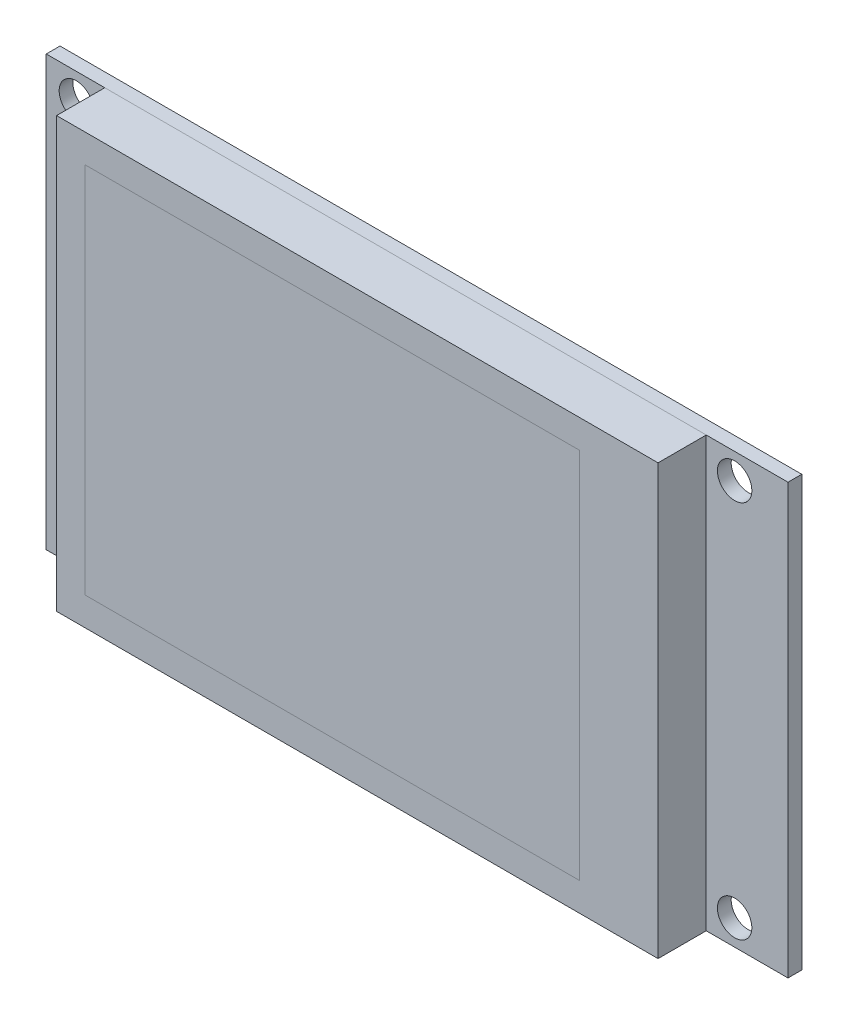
from build123d import *

# Parameters (mm, degrees)
ESQUISSE4_W             = 57.5
ESQUISSE4_H             = 43.3
BOSS_EXTRU_3_DEPTH      = 0.2
ESQUISSE5_W             = 69.9
ESQUISSE5_H             = 49.9
ESQUISSE5_W_2           = 57.5
ESQUISSE5_H_2           = 43.3
BOSS_EXTRU_4_DEPTH      = 5.6
ESQUISSE6_W             = 86.2
ESQUISSE6_H             = 49.9
BOSS_EXTRU_5_DEPTH      = 1.6
ESQUISSE7_R             = 2
ENL_V_MAT_EXTRU_1_DEPTH = 54.813427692


with BuildPart() as part:
    # Esquisse4 → Boss.-Extru.3 (new body)
    with BuildSketch(Plane.XY):
        Rectangle(ESQUISSE4_W, ESQUISSE4_H)
    extrude(amount=-BOSS_EXTRU_3_DEPTH)


with BuildPart() as body_2:
    # Esquisse5 → Boss.-Extru.4 (new body)
    with BuildSketch(Plane.XY):
        with Locations((2.9, 0)):
            Rectangle(ESQUISSE5_W, ESQUISSE5_H)
        Rectangle(ESQUISSE5_W_2, ESQUISSE5_H_2, mode=Mode.SUBTRACT)
    extrude(amount=-BOSS_EXTRU_4_DEPTH)


with BuildPart() as body_3:
    # Esquisse6 → Boss.-Extru.5 (new body)
    with BuildSketch(Plane(origin=(0, 0, -5.6), x_dir=(-1, 0, 0), z_dir=(0, 0, -1))):
        with Locations((-4.25, 0)):
            Rectangle(ESQUISSE6_W, ESQUISSE6_H)
    extrude(amount=BOSS_EXTRU_5_DEPTH)

    # Esquisse7 → Enl_v. mat.-Extru.1 (cut, through all)
    with BuildSketch(Plane.XY.offset(-5.6)):
        with Locations((-35.35, 22)):
            Circle(ESQUISSE7_R)
        with Locations((-35.35, -22)):
            Circle(ESQUISSE7_R)
        with Locations((41.15, 22)):
            Circle(ESQUISSE7_R)
        with Locations((41.15, -22)):
            Circle(ESQUISSE7_R)
    extrude(amount=-ENL_V_MAT_EXTRU_1_DEPTH, mode=Mode.SUBTRACT)


solid = Compound([part.part, body_2.part, body_3.part])
